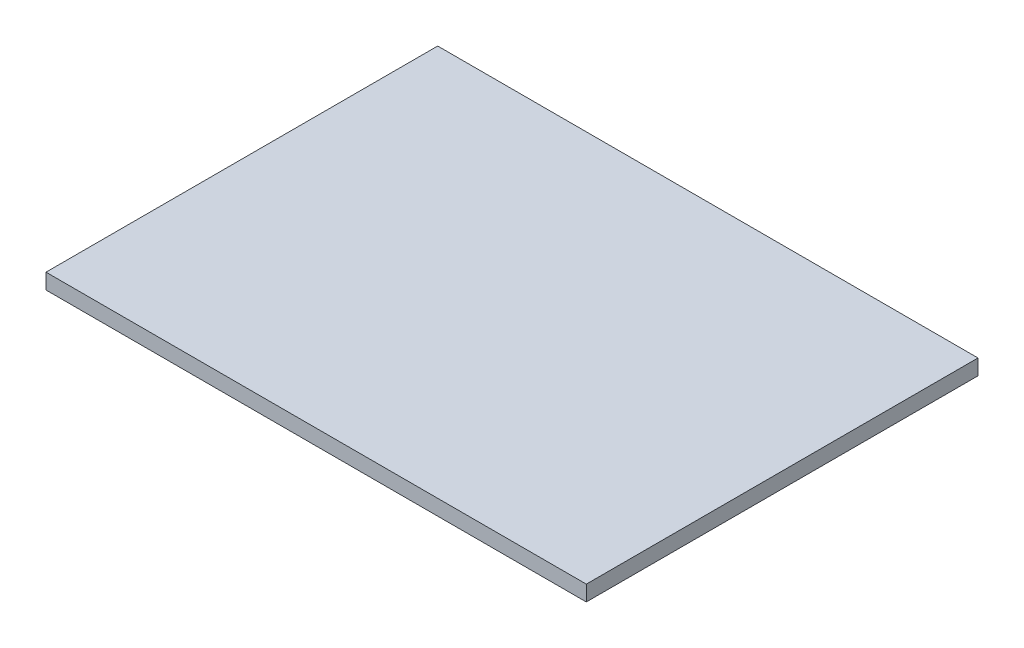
ISO-10303-21;
HEADER;
FILE_DESCRIPTION(('STEP AP214'),'2;1');
FILE_NAME('part.step','',(''),(''),'','','');
FILE_SCHEMA(('AUTOMOTIVE_DESIGN { 1 0 10303 214 1 1 1 1 }'));
ENDSEC;
DATA;
#1=APPLICATION_CONTEXT('core data for automotive mechanical design processes');
#2=APPLICATION_PROTOCOL_DEFINITION('international standard','automotive_design',2000,#1);
#3=PRODUCT_CONTEXT('',#1,'mechanical');
#4=PRODUCT('Part','Part','',(#3));
#5=PRODUCT_RELATED_PRODUCT_CATEGORY('part','',(#4));
#6=PRODUCT_DEFINITION_FORMATION('','',#4);
#7=PRODUCT_DEFINITION_CONTEXT('part definition',#1,'design');
#8=PRODUCT_DEFINITION('design','',#6,#7);
#9=PRODUCT_DEFINITION_SHAPE('','',#8);
#10=(LENGTH_UNIT() NAMED_UNIT(*) SI_UNIT(.MILLI.,.METRE.));
#11=(NAMED_UNIT(*) PLANE_ANGLE_UNIT() SI_UNIT($,.RADIAN.));
#12=(NAMED_UNIT(*) SI_UNIT($,.STERADIAN.) SOLID_ANGLE_UNIT());
#13=UNCERTAINTY_MEASURE_WITH_UNIT(LENGTH_MEASURE(1.E-05),#10,'distance_accuracy_value','');
#14=(GEOMETRIC_REPRESENTATION_CONTEXT(3) GLOBAL_UNCERTAINTY_ASSIGNED_CONTEXT((#13)) GLOBAL_UNIT_ASSIGNED_CONTEXT((#10,
#11,#12)) REPRESENTATION_CONTEXT('',''));
#15=CARTESIAN_POINT('',(0.,0.,0.));
#16=DIRECTION('',(0.,0.,1.));
#17=DIRECTION('',(1.,0.,0.));
#18=AXIS2_PLACEMENT_3D('',#15,#16,#17);
#19=CARTESIAN_POINT('',(-349.,-10.,253.));
#20=DIRECTION('',(0.,1.,0.));
#21=DIRECTION('',(-1.,0.,0.));
#22=AXIS2_PLACEMENT_3D('',#19,#20,#21);
#23=PLANE('',#22);
#24=DIRECTION('',(1.,0.,0.));
#25=VECTOR('',#24,1.);
#26=CARTESIAN_POINT('',(-349.,-10.,-253.));
#27=LINE('',#26,#25);
#28=CARTESIAN_POINT('',(-349.,-10.,-253.));
#29=VERTEX_POINT('',#28);
#30=CARTESIAN_POINT('',(349.,-10.,-253.));
#31=VERTEX_POINT('',#30);
#32=EDGE_CURVE('E91',#29,#31,#27,.T.);
#33=ORIENTED_EDGE('',*,*,#32,.T.);
#34=DIRECTION('',(0.,0.,-1.));
#35=VECTOR('',#34,1.);
#36=CARTESIAN_POINT('',(349.,-10.,253.));
#37=LINE('',#36,#35);
#38=CARTESIAN_POINT('',(349.,-10.,253.));
#39=VERTEX_POINT('',#38);
#40=EDGE_CURVE('E44',#39,#31,#37,.T.);
#41=ORIENTED_EDGE('',*,*,#40,.F.);
#42=DIRECTION('',(1.,0.,0.));
#43=VECTOR('',#42,1.);
#44=CARTESIAN_POINT('',(-349.,-10.,253.));
#45=LINE('',#44,#43);
#46=CARTESIAN_POINT('',(-349.,-10.,253.));
#47=VERTEX_POINT('',#46);
#48=EDGE_CURVE('E82',#47,#39,#45,.T.);
#49=ORIENTED_EDGE('',*,*,#48,.F.);
#50=DIRECTION('',(0.,0.,-1.));
#51=VECTOR('',#50,1.);
#52=CARTESIAN_POINT('',(-349.,-10.,253.));
#53=LINE('',#52,#51);
#54=EDGE_CURVE('E11',#47,#29,#53,.T.);
#55=ORIENTED_EDGE('',*,*,#54,.T.);
#56=EDGE_LOOP('',(#33,#41,#49,#55));
#57=FACE_BOUND('',#56,.T.);
#58=CARTESIAN_POINT('',(-250.,-10.,231.099999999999));
#59=DIRECTION('',(0.,-1.,0.));
#60=DIRECTION('',(1.,0.,0.));
#61=AXIS2_PLACEMENT_3D('',#58,#59,#60);
#62=CIRCLE('',#61,17.5);
#63=CARTESIAN_POINT('',(-232.5,-10.,231.099999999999));
#64=VERTEX_POINT('',#63);
#65=EDGE_CURVE('E113',#64,#64,#62,.T.);
#66=ORIENTED_EDGE('',*,*,#65,.F.);
#67=EDGE_LOOP('',(#66));
#68=FACE_BOUND('',#67,.T.);
#69=CARTESIAN_POINT('',(250.,-10.,231.099999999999));
#70=DIRECTION('',(0.,1.,0.));
#71=DIRECTION('',(-1.,0.,0.));
#72=AXIS2_PLACEMENT_3D('',#69,#70,#71);
#73=CIRCLE('',#72,17.5);
#74=CARTESIAN_POINT('',(232.5,-10.,231.099999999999));
#75=VERTEX_POINT('',#74);
#76=EDGE_CURVE('E119',#75,#75,#73,.T.);
#77=ORIENTED_EDGE('',*,*,#76,.T.);
#78=EDGE_LOOP('',(#77));
#79=FACE_BOUND('',#78,.T.);
#80=ADVANCED_FACE('F35',(#57,#68,#79),#23,.F.);
#81=CARTESIAN_POINT('',(-349.,9.99999999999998,253.));
#82=DIRECTION('',(1.,0.,0.));
#83=DIRECTION('',(0.,0.,-1.));
#84=AXIS2_PLACEMENT_3D('',#81,#82,#83);
#85=PLANE('',#84);
#86=DIRECTION('',(0.,-1.,0.));
#87=VECTOR('',#86,1.);
#88=CARTESIAN_POINT('',(-349.,9.99999999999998,-253.));
#89=LINE('',#88,#87);
#90=CARTESIAN_POINT('',(-349.,9.99999999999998,-253.));
#91=VERTEX_POINT('',#90);
#92=EDGE_CURVE('E99',#91,#29,#89,.T.);
#93=ORIENTED_EDGE('',*,*,#92,.T.);
#94=ORIENTED_EDGE('',*,*,#54,.F.);
#95=DIRECTION('',(0.,-1.,0.));
#96=VECTOR('',#95,1.);
#97=CARTESIAN_POINT('',(-349.,9.99999999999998,253.));
#98=LINE('',#97,#96);
#99=CARTESIAN_POINT('',(-349.,9.99999999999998,253.));
#100=VERTEX_POINT('',#99);
#101=EDGE_CURVE('E87',#100,#47,#98,.T.);
#102=ORIENTED_EDGE('',*,*,#101,.F.);
#103=DIRECTION('',(0.,0.,-1.));
#104=VECTOR('',#103,1.);
#105=CARTESIAN_POINT('',(-349.,9.99999999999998,253.));
#106=LINE('',#105,#104);
#107=EDGE_CURVE('E95',#100,#91,#106,.T.);
#108=ORIENTED_EDGE('',*,*,#107,.T.);
#109=EDGE_LOOP('',(#93,#94,#102,#108));
#110=FACE_BOUND('',#109,.T.);
#111=ADVANCED_FACE('F37',(#110),#85,.F.);
#112=CARTESIAN_POINT('',(349.,9.99999999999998,253.));
#113=DIRECTION('',(-1.,0.,0.));
#114=DIRECTION('',(0.,0.,1.));
#115=AXIS2_PLACEMENT_3D('',#112,#113,#114);
#116=PLANE('',#115);
#117=DIRECTION('',(0.,1.,0.));
#118=VECTOR('',#117,1.);
#119=CARTESIAN_POINT('',(349.,9.99999999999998,-253.));
#120=LINE('',#119,#118);
#121=CARTESIAN_POINT('',(349.,9.99999999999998,-253.));
#122=VERTEX_POINT('',#121);
#123=EDGE_CURVE('E69',#31,#122,#120,.T.);
#124=ORIENTED_EDGE('',*,*,#123,.T.);
#125=DIRECTION('',(0.,0.,-1.));
#126=VECTOR('',#125,1.);
#127=CARTESIAN_POINT('',(349.,9.99999999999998,253.));
#128=LINE('',#127,#126);
#129=CARTESIAN_POINT('',(349.,9.99999999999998,253.));
#130=VERTEX_POINT('',#129);
#131=EDGE_CURVE('E92',#130,#122,#128,.T.);
#132=ORIENTED_EDGE('',*,*,#131,.F.);
#133=DIRECTION('',(0.,1.,0.));
#134=VECTOR('',#133,1.);
#135=CARTESIAN_POINT('',(349.,9.99999999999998,253.));
#136=LINE('',#135,#134);
#137=EDGE_CURVE('E85',#39,#130,#136,.T.);
#138=ORIENTED_EDGE('',*,*,#137,.F.);
#139=ORIENTED_EDGE('',*,*,#40,.T.);
#140=EDGE_LOOP('',(#124,#132,#138,#139));
#141=FACE_BOUND('',#140,.T.);
#142=ADVANCED_FACE('F93',(#141),#116,.F.);
#143=CARTESIAN_POINT('',(-349.,9.99999999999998,253.));
#144=DIRECTION('',(0.,-1.,0.));
#145=DIRECTION('',(0.,0.,-1.));
#146=AXIS2_PLACEMENT_3D('',#143,#144,#145);
#147=PLANE('',#146);
#148=DIRECTION('',(-1.,0.,0.));
#149=VECTOR('',#148,1.);
#150=CARTESIAN_POINT('',(-349.,9.99999999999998,-253.));
#151=LINE('',#150,#149);
#152=EDGE_CURVE('E75',#122,#91,#151,.T.);
#153=ORIENTED_EDGE('',*,*,#152,.T.);
#154=ORIENTED_EDGE('',*,*,#107,.F.);
#155=DIRECTION('',(-1.,0.,0.));
#156=VECTOR('',#155,1.);
#157=CARTESIAN_POINT('',(-349.,9.99999999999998,253.));
#158=LINE('',#157,#156);
#159=EDGE_CURVE('E52',#130,#100,#158,.T.);
#160=ORIENTED_EDGE('',*,*,#159,.F.);
#161=ORIENTED_EDGE('',*,*,#131,.T.);
#162=EDGE_LOOP('',(#153,#154,#160,#161));
#163=FACE_BOUND('',#162,.T.);
#164=ADVANCED_FACE('F107',(#163),#147,.F.);
#165=CARTESIAN_POINT('',(-349.,9.99999999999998,253.));
#166=DIRECTION('',(0.,0.,1.));
#167=DIRECTION('',(1.,0.,0.));
#168=AXIS2_PLACEMENT_3D('',#165,#166,#167);
#169=PLANE('',#168);
#170=ORIENTED_EDGE('',*,*,#101,.T.);
#171=ORIENTED_EDGE('',*,*,#48,.T.);
#172=ORIENTED_EDGE('',*,*,#137,.T.);
#173=ORIENTED_EDGE('',*,*,#159,.T.);
#174=EDGE_LOOP('',(#170,#171,#172,#173));
#175=FACE_BOUND('',#174,.T.);
#176=ADVANCED_FACE('F83',(#175),#169,.T.);
#177=CARTESIAN_POINT('',(-349.,9.99999999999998,-253.));
#178=DIRECTION('',(0.,0.,1.));
#179=DIRECTION('',(1.,0.,0.));
#180=AXIS2_PLACEMENT_3D('',#177,#178,#179);
#181=PLANE('',#180);
#182=ORIENTED_EDGE('',*,*,#92,.F.);
#183=ORIENTED_EDGE('',*,*,#152,.F.);
#184=ORIENTED_EDGE('',*,*,#123,.F.);
#185=ORIENTED_EDGE('',*,*,#32,.F.);
#186=EDGE_LOOP('',(#182,#183,#184,#185));
#187=FACE_BOUND('',#186,.T.);
#188=ADVANCED_FACE('F110',(#187),#181,.F.);
#189=CARTESIAN_POINT('',(-250.,1.99999999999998,231.099999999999));
#190=DIRECTION('',(0.,-1.,0.));
#191=DIRECTION('',(1.,0.,0.));
#192=AXIS2_PLACEMENT_3D('',#189,#190,#191);
#193=CYLINDRICAL_SURFACE('',#192,17.5);
#194=CARTESIAN_POINT('',(-250.,1.99999999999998,231.099999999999));
#195=DIRECTION('',(0.,-1.,0.));
#196=DIRECTION('',(1.,0.,0.));
#197=AXIS2_PLACEMENT_3D('',#194,#195,#196);
#198=CIRCLE('',#197,17.5);
#199=CARTESIAN_POINT('',(-232.5,1.99999999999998,231.099999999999));
#200=VERTEX_POINT('',#199);
#201=EDGE_CURVE('E102',#200,#200,#198,.T.);
#202=ORIENTED_EDGE('',*,*,#201,.F.);
#203=EDGE_LOOP('',(#202));
#204=FACE_BOUND('',#203,.T.);
#205=ORIENTED_EDGE('',*,*,#65,.T.);
#206=EDGE_LOOP('',(#205));
#207=FACE_BOUND('',#206,.T.);
#208=ADVANCED_FACE('F149',(#204,#207),#193,.F.);
#209=CARTESIAN_POINT('',(-250.,1.99999999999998,231.099999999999));
#210=DIRECTION('',(0.,-1.,0.));
#211=DIRECTION('',(1.,0.,0.));
#212=AXIS2_PLACEMENT_3D('',#209,#210,#211);
#213=PLANE('',#212);
#214=ORIENTED_EDGE('',*,*,#201,.T.);
#215=EDGE_LOOP('',(#214));
#216=FACE_BOUND('',#215,.T.);
#217=ADVANCED_FACE('F134',(#216),#213,.T.);
#218=CARTESIAN_POINT('',(250.,1.99999999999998,231.099999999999));
#219=DIRECTION('',(0.,-1.,0.));
#220=DIRECTION('',(1.,0.,0.));
#221=AXIS2_PLACEMENT_3D('',#218,#219,#220);
#222=CYLINDRICAL_SURFACE('',#221,17.5);
#223=CARTESIAN_POINT('',(250.,1.99999999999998,231.099999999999));
#224=DIRECTION('',(0.,1.,0.));
#225=DIRECTION('',(-1.,0.,0.));
#226=AXIS2_PLACEMENT_3D('',#223,#224,#225);
#227=CIRCLE('',#226,17.5);
#228=CARTESIAN_POINT('',(232.5,1.99999999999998,231.099999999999));
#229=VERTEX_POINT('',#228);
#230=EDGE_CURVE('E116',#229,#229,#227,.T.);
#231=ORIENTED_EDGE('',*,*,#230,.T.);
#232=EDGE_LOOP('',(#231));
#233=FACE_BOUND('',#232,.T.);
#234=ORIENTED_EDGE('',*,*,#76,.F.);
#235=EDGE_LOOP('',(#234));
#236=FACE_BOUND('',#235,.T.);
#237=ADVANCED_FACE('F125',(#233,#236),#222,.F.);
#238=CARTESIAN_POINT('',(250.,1.99999999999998,231.099999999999));
#239=DIRECTION('',(0.,-1.,0.));
#240=DIRECTION('',(-1.,0.,0.));
#241=AXIS2_PLACEMENT_3D('',#238,#239,#240);
#242=PLANE('',#241);
#243=ORIENTED_EDGE('',*,*,#230,.F.);
#244=EDGE_LOOP('',(#243));
#245=FACE_BOUND('',#244,.T.);
#246=ADVANCED_FACE('F128',(#245),#242,.T.);
#247=CLOSED_SHELL('',(#80,#111,#142,#164,#176,#188,#208,#217,#237,#246));
#248=MANIFOLD_SOLID_BREP('B2',#247);
#249=ADVANCED_BREP_SHAPE_REPRESENTATION('',(#18,#248),#14);
#250=SHAPE_DEFINITION_REPRESENTATION(#9,#249);
ENDSEC;
END-ISO-10303-21;
